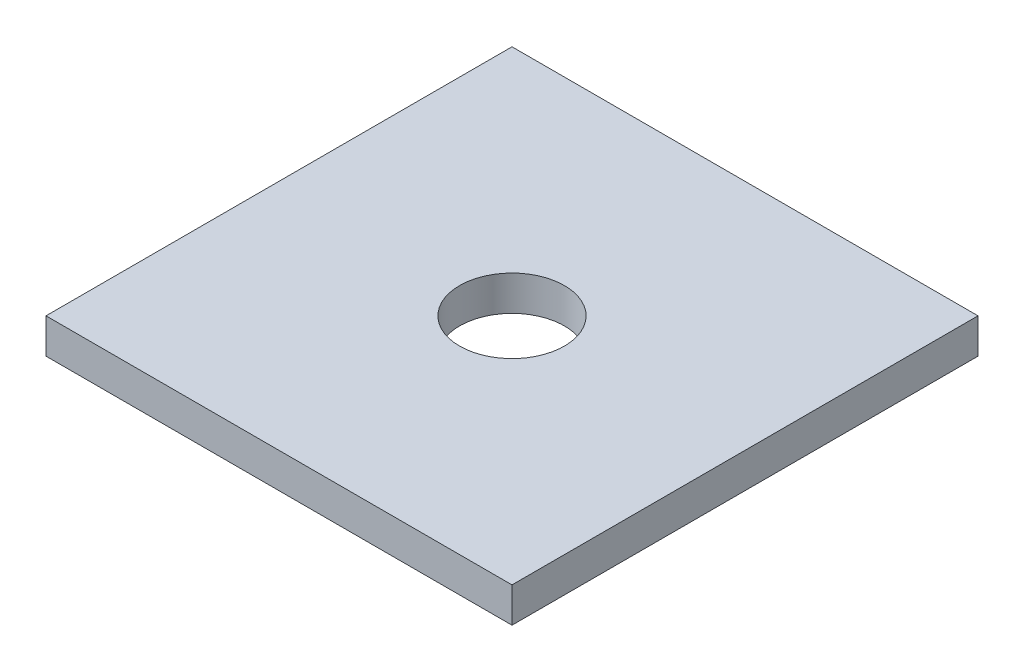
ISO-10303-21;
HEADER;
FILE_DESCRIPTION(('STEP AP214'),'2;1');
FILE_NAME('part.step','',(''),(''),'','','');
FILE_SCHEMA(('AUTOMOTIVE_DESIGN { 1 0 10303 214 1 1 1 1 }'));
ENDSEC;
DATA;
#1=APPLICATION_CONTEXT('core data for automotive mechanical design processes');
#2=APPLICATION_PROTOCOL_DEFINITION('international standard','automotive_design',2000,#1);
#3=PRODUCT_CONTEXT('',#1,'mechanical');
#4=PRODUCT('Part','Part','',(#3));
#5=PRODUCT_RELATED_PRODUCT_CATEGORY('part','',(#4));
#6=PRODUCT_DEFINITION_FORMATION('','',#4);
#7=PRODUCT_DEFINITION_CONTEXT('part definition',#1,'design');
#8=PRODUCT_DEFINITION('design','',#6,#7);
#9=PRODUCT_DEFINITION_SHAPE('','',#8);
#10=(LENGTH_UNIT() NAMED_UNIT(*) SI_UNIT(.MILLI.,.METRE.));
#11=(NAMED_UNIT(*) PLANE_ANGLE_UNIT() SI_UNIT($,.RADIAN.));
#12=(NAMED_UNIT(*) SI_UNIT($,.STERADIAN.) SOLID_ANGLE_UNIT());
#13=UNCERTAINTY_MEASURE_WITH_UNIT(LENGTH_MEASURE(1.E-05),#10,'distance_accuracy_value','');
#14=(GEOMETRIC_REPRESENTATION_CONTEXT(3) GLOBAL_UNCERTAINTY_ASSIGNED_CONTEXT((#13)) GLOBAL_UNIT_ASSIGNED_CONTEXT((#10,
#11,#12)) REPRESENTATION_CONTEXT('',''));
#15=CARTESIAN_POINT('',(0.,0.,0.));
#16=DIRECTION('',(0.,0.,1.));
#17=DIRECTION('',(1.,0.,0.));
#18=AXIS2_PLACEMENT_3D('',#15,#16,#17);
#19=CARTESIAN_POINT('',(0.,3.,-40.));
#20=DIRECTION('',(0.,-1.,0.));
#21=DIRECTION('',(0.,0.,-1.));
#22=AXIS2_PLACEMENT_3D('',#19,#20,#21);
#23=PLANE('',#22);
#24=DIRECTION('',(0.,0.,1.));
#25=VECTOR('',#24,1.);
#26=CARTESIAN_POINT('',(0.,3.,0.));
#27=LINE('',#26,#25);
#28=CARTESIAN_POINT('',(0.,3.,-40.));
#29=VERTEX_POINT('',#28);
#30=CARTESIAN_POINT('',(0.,3.,0.));
#31=VERTEX_POINT('',#30);
#32=EDGE_CURVE('E83',#29,#31,#27,.T.);
#33=ORIENTED_EDGE('',*,*,#32,.T.);
#34=DIRECTION('',(1.,0.,0.));
#35=VECTOR('',#34,1.);
#36=CARTESIAN_POINT('',(0.,3.,0.));
#37=LINE('',#36,#35);
#38=CARTESIAN_POINT('',(40.,3.,0.));
#39=VERTEX_POINT('',#38);
#40=EDGE_CURVE('E78',#31,#39,#37,.T.);
#41=ORIENTED_EDGE('',*,*,#40,.T.);
#42=DIRECTION('',(0.,0.,-1.));
#43=VECTOR('',#42,1.);
#44=CARTESIAN_POINT('',(40.,3.,0.));
#45=LINE('',#44,#43);
#46=CARTESIAN_POINT('',(40.,3.,-40.));
#47=VERTEX_POINT('',#46);
#48=EDGE_CURVE('E81',#39,#47,#45,.T.);
#49=ORIENTED_EDGE('',*,*,#48,.T.);
#50=DIRECTION('',(-1.,0.,0.));
#51=VECTOR('',#50,1.);
#52=CARTESIAN_POINT('',(0.,3.,-40.));
#53=LINE('',#52,#51);
#54=EDGE_CURVE('E48',#47,#29,#53,.T.);
#55=ORIENTED_EDGE('',*,*,#54,.T.);
#56=EDGE_LOOP('',(#33,#41,#49,#55));
#57=FACE_BOUND('',#56,.T.);
#58=CARTESIAN_POINT('',(20.,3.,-20.));
#59=DIRECTION('',(0.,1.,0.));
#60=DIRECTION('',(0.,0.,1.));
#61=AXIS2_PLACEMENT_3D('',#58,#59,#60);
#62=CIRCLE('',#61,4.5);
#63=CARTESIAN_POINT('',(20.,3.,-15.5));
#64=VERTEX_POINT('',#63);
#65=EDGE_CURVE('E98',#64,#64,#62,.T.);
#66=ORIENTED_EDGE('',*,*,#65,.F.);
#67=EDGE_LOOP('',(#66));
#68=FACE_BOUND('',#67,.T.);
#69=ADVANCED_FACE('F31',(#57,#68),#23,.F.);
#70=CARTESIAN_POINT('',(0.,0.,-40.));
#71=DIRECTION('',(0.,-1.,0.));
#72=DIRECTION('',(0.,0.,-1.));
#73=AXIS2_PLACEMENT_3D('',#70,#71,#72);
#74=PLANE('',#73);
#75=DIRECTION('',(0.,0.,1.));
#76=VECTOR('',#75,1.);
#77=CARTESIAN_POINT('',(0.,0.,0.));
#78=LINE('',#77,#76);
#79=CARTESIAN_POINT('',(0.,0.,-40.));
#80=VERTEX_POINT('',#79);
#81=CARTESIAN_POINT('',(0.,0.,0.));
#82=VERTEX_POINT('',#81);
#83=EDGE_CURVE('E95',#80,#82,#78,.T.);
#84=ORIENTED_EDGE('',*,*,#83,.F.);
#85=DIRECTION('',(-1.,0.,0.));
#86=VECTOR('',#85,1.);
#87=CARTESIAN_POINT('',(0.,0.,-40.));
#88=LINE('',#87,#86);
#89=CARTESIAN_POINT('',(40.,0.,-40.));
#90=VERTEX_POINT('',#89);
#91=EDGE_CURVE('E71',#90,#80,#88,.T.);
#92=ORIENTED_EDGE('',*,*,#91,.F.);
#93=DIRECTION('',(0.,0.,-1.));
#94=VECTOR('',#93,1.);
#95=CARTESIAN_POINT('',(40.,0.,0.));
#96=LINE('',#95,#94);
#97=CARTESIAN_POINT('',(40.,0.,0.));
#98=VERTEX_POINT('',#97);
#99=EDGE_CURVE('E65',#98,#90,#96,.T.);
#100=ORIENTED_EDGE('',*,*,#99,.F.);
#101=DIRECTION('',(1.,0.,0.));
#102=VECTOR('',#101,1.);
#103=CARTESIAN_POINT('',(0.,0.,0.));
#104=LINE('',#103,#102);
#105=EDGE_CURVE('E87',#82,#98,#104,.T.);
#106=ORIENTED_EDGE('',*,*,#105,.F.);
#107=EDGE_LOOP('',(#84,#92,#100,#106));
#108=FACE_BOUND('',#107,.T.);
#109=CARTESIAN_POINT('',(20.,0.,-20.));
#110=DIRECTION('',(0.,1.,0.));
#111=DIRECTION('',(0.,0.,1.));
#112=AXIS2_PLACEMENT_3D('',#109,#110,#111);
#113=CIRCLE('',#112,4.5);
#114=CARTESIAN_POINT('',(20.,0.,-15.5));
#115=VERTEX_POINT('',#114);
#116=EDGE_CURVE('E110',#115,#115,#113,.T.);
#117=ORIENTED_EDGE('',*,*,#116,.T.);
#118=EDGE_LOOP('',(#117));
#119=FACE_BOUND('',#118,.T.);
#120=ADVANCED_FACE('F106',(#108,#119),#74,.T.);
#121=CARTESIAN_POINT('',(0.,3.,0.));
#122=DIRECTION('',(1.,0.,0.));
#123=DIRECTION('',(0.,0.,-1.));
#124=AXIS2_PLACEMENT_3D('',#121,#122,#123);
#125=PLANE('',#124);
#126=ORIENTED_EDGE('',*,*,#83,.T.);
#127=DIRECTION('',(0.,-1.,0.));
#128=VECTOR('',#127,1.);
#129=CARTESIAN_POINT('',(0.,3.,0.));
#130=LINE('',#129,#128);
#131=EDGE_CURVE('E11',#31,#82,#130,.T.);
#132=ORIENTED_EDGE('',*,*,#131,.F.);
#133=ORIENTED_EDGE('',*,*,#32,.F.);
#134=DIRECTION('',(0.,-1.,0.));
#135=VECTOR('',#134,1.);
#136=CARTESIAN_POINT('',(0.,3.,-40.));
#137=LINE('',#136,#135);
#138=EDGE_CURVE('E91',#29,#80,#137,.T.);
#139=ORIENTED_EDGE('',*,*,#138,.T.);
#140=EDGE_LOOP('',(#126,#132,#133,#139));
#141=FACE_BOUND('',#140,.T.);
#142=ADVANCED_FACE('F33',(#141),#125,.F.);
#143=CARTESIAN_POINT('',(0.,3.,0.));
#144=DIRECTION('',(0.,0.,-1.));
#145=DIRECTION('',(-1.,0.,0.));
#146=AXIS2_PLACEMENT_3D('',#143,#144,#145);
#147=PLANE('',#146);
#148=ORIENTED_EDGE('',*,*,#105,.T.);
#149=DIRECTION('',(0.,-1.,0.));
#150=VECTOR('',#149,1.);
#151=CARTESIAN_POINT('',(40.,3.,0.));
#152=LINE('',#151,#150);
#153=EDGE_CURVE('E40',#39,#98,#152,.T.);
#154=ORIENTED_EDGE('',*,*,#153,.F.);
#155=ORIENTED_EDGE('',*,*,#40,.F.);
#156=ORIENTED_EDGE('',*,*,#131,.T.);
#157=EDGE_LOOP('',(#148,#154,#155,#156));
#158=FACE_BOUND('',#157,.T.);
#159=ADVANCED_FACE('F86',(#158),#147,.F.);
#160=CARTESIAN_POINT('',(40.,3.,0.));
#161=DIRECTION('',(-1.,0.,0.));
#162=DIRECTION('',(0.,0.,1.));
#163=AXIS2_PLACEMENT_3D('',#160,#161,#162);
#164=PLANE('',#163);
#165=ORIENTED_EDGE('',*,*,#99,.T.);
#166=DIRECTION('',(0.,-1.,0.));
#167=VECTOR('',#166,1.);
#168=CARTESIAN_POINT('',(40.,3.,-40.));
#169=LINE('',#168,#167);
#170=EDGE_CURVE('E88',#47,#90,#169,.T.);
#171=ORIENTED_EDGE('',*,*,#170,.F.);
#172=ORIENTED_EDGE('',*,*,#48,.F.);
#173=ORIENTED_EDGE('',*,*,#153,.T.);
#174=EDGE_LOOP('',(#165,#171,#172,#173));
#175=FACE_BOUND('',#174,.T.);
#176=ADVANCED_FACE('F89',(#175),#164,.F.);
#177=CARTESIAN_POINT('',(0.,3.,-40.));
#178=DIRECTION('',(0.,0.,1.));
#179=DIRECTION('',(1.,0.,0.));
#180=AXIS2_PLACEMENT_3D('',#177,#178,#179);
#181=PLANE('',#180);
#182=ORIENTED_EDGE('',*,*,#91,.T.);
#183=ORIENTED_EDGE('',*,*,#138,.F.);
#184=ORIENTED_EDGE('',*,*,#54,.F.);
#185=ORIENTED_EDGE('',*,*,#170,.T.);
#186=EDGE_LOOP('',(#182,#183,#184,#185));
#187=FACE_BOUND('',#186,.T.);
#188=ADVANCED_FACE('F103',(#187),#181,.F.);
#189=CARTESIAN_POINT('',(20.,3.,-20.));
#190=DIRECTION('',(0.,-1.,0.));
#191=DIRECTION('',(0.,0.,-1.));
#192=AXIS2_PLACEMENT_3D('',#189,#190,#191);
#193=CYLINDRICAL_SURFACE('',#192,4.5);
#194=ORIENTED_EDGE('',*,*,#65,.T.);
#195=EDGE_LOOP('',(#194));
#196=FACE_BOUND('',#195,.T.);
#197=ORIENTED_EDGE('',*,*,#116,.F.);
#198=EDGE_LOOP('',(#197));
#199=FACE_BOUND('',#198,.T.);
#200=ADVANCED_FACE('F116',(#196,#199),#193,.F.);
#201=CLOSED_SHELL('',(#69,#120,#142,#159,#176,#188,#200));
#202=MANIFOLD_SOLID_BREP('B2',#201);
#203=ADVANCED_BREP_SHAPE_REPRESENTATION('',(#18,#202),#14);
#204=SHAPE_DEFINITION_REPRESENTATION(#9,#203);
ENDSEC;
END-ISO-10303-21;
